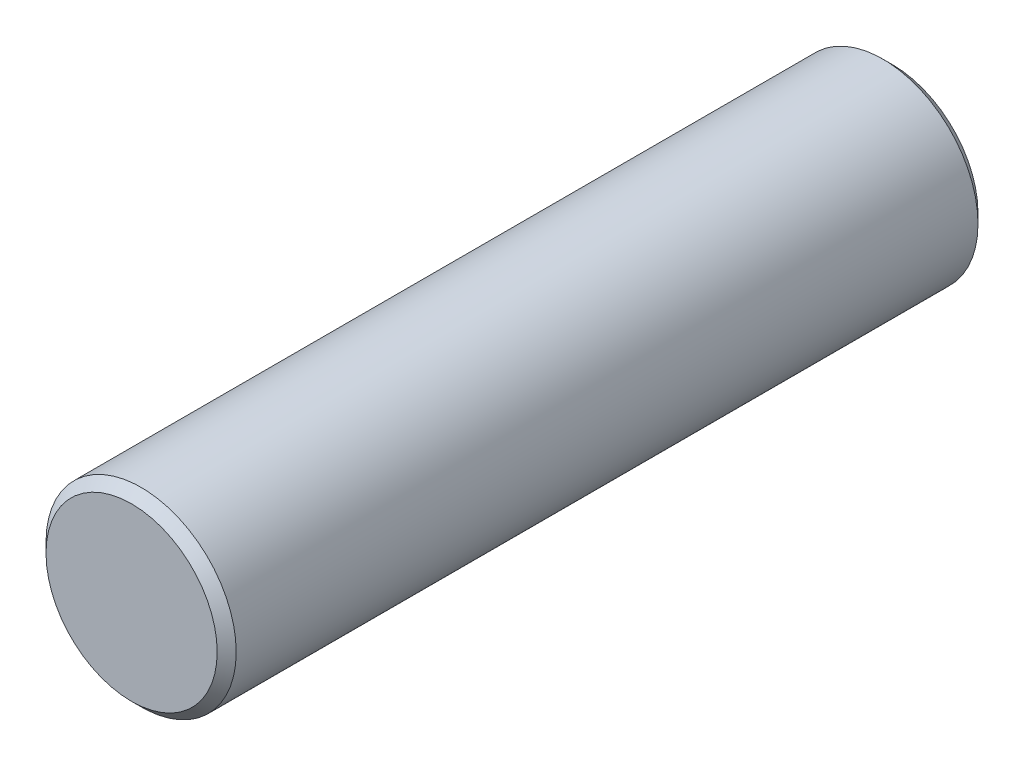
from build123d import *

# Parameters (mm, degrees)
SZKIC1_R                    = 5
DODANIE_WYCI_GNI_CIE1_DEPTH = 40
SFAZOWANIE1_SIZE            = 0.5


with BuildPart() as part:
    # Szkic1 → Dodanie-wyci_gni_cie1 (new body)
    with BuildSketch(Plane.XY):
        Circle(SZKIC1_R)
    extrude(amount=DODANIE_WYCI_GNI_CIE1_DEPTH)

    # Sfazowanie1
    sfazowanie1_edges = [part.edges().sort_by_distance(p)[0] for p in [
        (-5, 0, 0),
        (-5, 0, 40),
    ]]
    chamfer(sfazowanie1_edges, length=SFAZOWANIE1_SIZE)


solid = part.part
